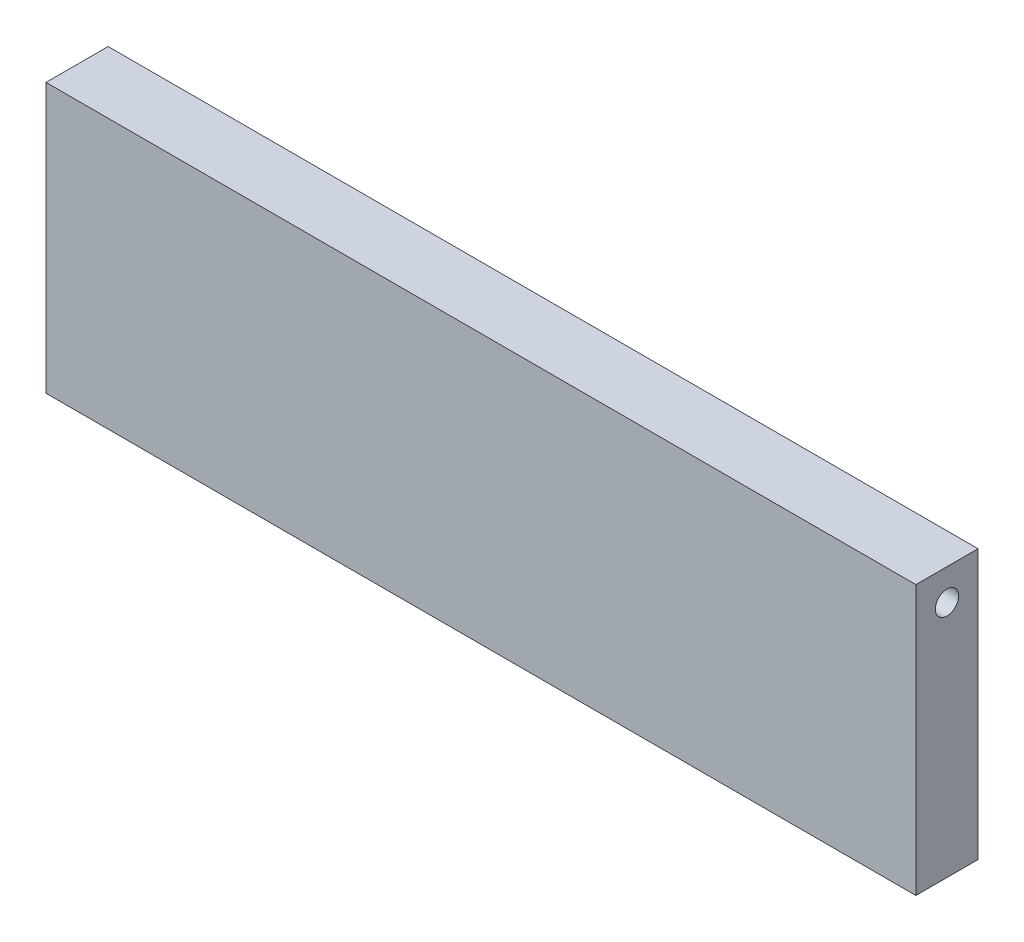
ISO-10303-21;
HEADER;
FILE_DESCRIPTION(('STEP AP214'),'2;1');
FILE_NAME('part.step','',(''),(''),'','','');
FILE_SCHEMA(('AUTOMOTIVE_DESIGN { 1 0 10303 214 1 1 1 1 }'));
ENDSEC;
DATA;
#1=APPLICATION_CONTEXT('core data for automotive mechanical design processes');
#2=APPLICATION_PROTOCOL_DEFINITION('international standard','automotive_design',2000,#1);
#3=PRODUCT_CONTEXT('',#1,'mechanical');
#4=PRODUCT('Part','Part','',(#3));
#5=PRODUCT_RELATED_PRODUCT_CATEGORY('part','',(#4));
#6=PRODUCT_DEFINITION_FORMATION('','',#4);
#7=PRODUCT_DEFINITION_CONTEXT('part definition',#1,'design');
#8=PRODUCT_DEFINITION('design','',#6,#7);
#9=PRODUCT_DEFINITION_SHAPE('','',#8);
#10=(LENGTH_UNIT() NAMED_UNIT(*) SI_UNIT(.MILLI.,.METRE.));
#11=(NAMED_UNIT(*) PLANE_ANGLE_UNIT() SI_UNIT($,.RADIAN.));
#12=(NAMED_UNIT(*) SI_UNIT($,.STERADIAN.) SOLID_ANGLE_UNIT());
#13=UNCERTAINTY_MEASURE_WITH_UNIT(LENGTH_MEASURE(1.E-05),#10,'distance_accuracy_value','');
#14=(GEOMETRIC_REPRESENTATION_CONTEXT(3) GLOBAL_UNCERTAINTY_ASSIGNED_CONTEXT((#13)) GLOBAL_UNIT_ASSIGNED_CONTEXT((#10,
#11,#12)) REPRESENTATION_CONTEXT('',''));
#15=CARTESIAN_POINT('',(0.,0.,0.));
#16=DIRECTION('',(0.,0.,1.));
#17=DIRECTION('',(1.,0.,0.));
#18=AXIS2_PLACEMENT_3D('',#15,#16,#17);
#19=CARTESIAN_POINT('',(228.,210.,-87.));
#20=DIRECTION('',(-1.,0.,0.));
#21=DIRECTION('',(0.,0.,1.));
#22=AXIS2_PLACEMENT_3D('',#19,#20,#21);
#23=PLANE('',#22);
#24=CARTESIAN_POINT('',(228.,256.,-81.));
#25=DIRECTION('',(-1.,0.,0.));
#26=DIRECTION('',(0.,0.,1.));
#27=AXIS2_PLACEMENT_3D('',#24,#25,#26);
#28=CIRCLE('',#27,2.24999999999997);
#29=CARTESIAN_POINT('',(228.,256.,-78.7500000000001));
#30=VERTEX_POINT('',#29);
#31=EDGE_CURVE('E38',#30,#30,#28,.T.);
#32=ORIENTED_EDGE('',*,*,#31,.T.);
#33=EDGE_LOOP('',(#32));
#34=FACE_BOUND('',#33,.T.);
#35=DIRECTION('',(0.,-1.,0.));
#36=VECTOR('',#35,1.);
#37=CARTESIAN_POINT('',(228.,210.,-75.));
#38=LINE('',#37,#36);
#39=CARTESIAN_POINT('',(228.,262.,-75.));
#40=VERTEX_POINT('',#39);
#41=CARTESIAN_POINT('',(228.,210.,-75.));
#42=VERTEX_POINT('',#41);
#43=EDGE_CURVE('E110',#40,#42,#38,.T.);
#44=ORIENTED_EDGE('',*,*,#43,.T.);
#45=DIRECTION('',(0.,0.,1.));
#46=VECTOR('',#45,1.);
#47=CARTESIAN_POINT('',(228.,210.,-87.));
#48=LINE('',#47,#46);
#49=CARTESIAN_POINT('',(228.,210.,-87.));
#50=VERTEX_POINT('',#49);
#51=EDGE_CURVE('E11',#50,#42,#48,.T.);
#52=ORIENTED_EDGE('',*,*,#51,.F.);
#53=DIRECTION('',(0.,-1.,0.));
#54=VECTOR('',#53,1.);
#55=CARTESIAN_POINT('',(228.,210.,-87.));
#56=LINE('',#55,#54);
#57=CARTESIAN_POINT('',(228.,262.,-87.));
#58=VERTEX_POINT('',#57);
#59=EDGE_CURVE('E120',#58,#50,#56,.T.);
#60=ORIENTED_EDGE('',*,*,#59,.F.);
#61=DIRECTION('',(0.,0.,1.));
#62=VECTOR('',#61,1.);
#63=CARTESIAN_POINT('',(228.,262.,-87.));
#64=LINE('',#63,#62);
#65=EDGE_CURVE('E126',#58,#40,#64,.T.);
#66=ORIENTED_EDGE('',*,*,#65,.T.);
#67=EDGE_LOOP('',(#44,#52,#60,#66));
#68=FACE_BOUND('',#67,.T.);
#69=ADVANCED_FACE('F35',(#34,#68),#23,.F.);
#70=CARTESIAN_POINT('',(228.,210.,-87.));
#71=DIRECTION('',(0.,1.,0.));
#72=DIRECTION('',(0.,0.,1.));
#73=AXIS2_PLACEMENT_3D('',#70,#71,#72);
#74=PLANE('',#73);
#75=DIRECTION('',(-1.,0.,0.));
#76=VECTOR('',#75,1.);
#77=CARTESIAN_POINT('',(228.,210.,-75.));
#78=LINE('',#77,#76);
#79=CARTESIAN_POINT('',(60.,210.,-75.));
#80=VERTEX_POINT('',#79);
#81=EDGE_CURVE('E129',#42,#80,#78,.T.);
#82=ORIENTED_EDGE('',*,*,#81,.T.);
#83=DIRECTION('',(0.,0.,1.));
#84=VECTOR('',#83,1.);
#85=CARTESIAN_POINT('',(60.,210.,-87.));
#86=LINE('',#85,#84);
#87=CARTESIAN_POINT('',(60.,210.,-87.));
#88=VERTEX_POINT('',#87);
#89=EDGE_CURVE('E44',#88,#80,#86,.T.);
#90=ORIENTED_EDGE('',*,*,#89,.F.);
#91=DIRECTION('',(-1.,0.,0.));
#92=VECTOR('',#91,1.);
#93=CARTESIAN_POINT('',(228.,210.,-87.));
#94=LINE('',#93,#92);
#95=EDGE_CURVE('E84',#50,#88,#94,.T.);
#96=ORIENTED_EDGE('',*,*,#95,.F.);
#97=ORIENTED_EDGE('',*,*,#51,.T.);
#98=EDGE_LOOP('',(#82,#90,#96,#97));
#99=FACE_BOUND('',#98,.T.);
#100=ADVANCED_FACE('F158',(#99),#74,.F.);
#101=CARTESIAN_POINT('',(60.,210.,-87.));
#102=DIRECTION('',(1.,0.,0.));
#103=DIRECTION('',(0.,0.,-1.));
#104=AXIS2_PLACEMENT_3D('',#101,#102,#103);
#105=PLANE('',#104);
#106=CARTESIAN_POINT('',(60.,256.,-81.));
#107=DIRECTION('',(1.,0.,0.));
#108=DIRECTION('',(0.,0.,-1.));
#109=AXIS2_PLACEMENT_3D('',#106,#107,#108);
#110=CIRCLE('',#109,2.24999999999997);
#111=CARTESIAN_POINT('',(60.,256.,-83.25));
#112=VERTEX_POINT('',#111);
#113=EDGE_CURVE('E106',#112,#112,#110,.T.);
#114=ORIENTED_EDGE('',*,*,#113,.T.);
#115=EDGE_LOOP('',(#114));
#116=FACE_BOUND('',#115,.T.);
#117=DIRECTION('',(0.,1.,0.));
#118=VECTOR('',#117,1.);
#119=CARTESIAN_POINT('',(60.,210.,-75.));
#120=LINE('',#119,#118);
#121=CARTESIAN_POINT('',(60.,262.,-75.));
#122=VERTEX_POINT('',#121);
#123=EDGE_CURVE('E71',#80,#122,#120,.T.);
#124=ORIENTED_EDGE('',*,*,#123,.T.);
#125=DIRECTION('',(0.,0.,1.));
#126=VECTOR('',#125,1.);
#127=CARTESIAN_POINT('',(60.,262.,-87.));
#128=LINE('',#127,#126);
#129=CARTESIAN_POINT('',(60.,262.,-87.));
#130=VERTEX_POINT('',#129);
#131=EDGE_CURVE('E134',#130,#122,#128,.T.);
#132=ORIENTED_EDGE('',*,*,#131,.F.);
#133=DIRECTION('',(0.,1.,0.));
#134=VECTOR('',#133,1.);
#135=CARTESIAN_POINT('',(60.,210.,-87.));
#136=LINE('',#135,#134);
#137=EDGE_CURVE('E123',#88,#130,#136,.T.);
#138=ORIENTED_EDGE('',*,*,#137,.F.);
#139=ORIENTED_EDGE('',*,*,#89,.T.);
#140=EDGE_LOOP('',(#124,#132,#138,#139));
#141=FACE_BOUND('',#140,.T.);
#142=ADVANCED_FACE('F139',(#116,#141),#105,.F.);
#143=CARTESIAN_POINT('',(228.,262.,-87.));
#144=DIRECTION('',(0.,-1.,0.));
#145=DIRECTION('',(0.,0.,-1.));
#146=AXIS2_PLACEMENT_3D('',#143,#144,#145);
#147=PLANE('',#146);
#148=DIRECTION('',(1.,0.,0.));
#149=VECTOR('',#148,1.);
#150=CARTESIAN_POINT('',(228.,262.,-75.));
#151=LINE('',#150,#149);
#152=EDGE_CURVE('E77',#122,#40,#151,.T.);
#153=ORIENTED_EDGE('',*,*,#152,.T.);
#154=ORIENTED_EDGE('',*,*,#65,.F.);
#155=DIRECTION('',(1.,0.,0.));
#156=VECTOR('',#155,1.);
#157=CARTESIAN_POINT('',(228.,262.,-87.));
#158=LINE('',#157,#156);
#159=EDGE_CURVE('E53',#130,#58,#158,.T.);
#160=ORIENTED_EDGE('',*,*,#159,.F.);
#161=ORIENTED_EDGE('',*,*,#131,.T.);
#162=EDGE_LOOP('',(#153,#154,#160,#161));
#163=FACE_BOUND('',#162,.T.);
#164=ADVANCED_FACE('F173',(#163),#147,.F.);
#165=CARTESIAN_POINT('',(0.,0.,-87.));
#166=DIRECTION('',(0.,0.,1.));
#167=DIRECTION('',(1.,0.,0.));
#168=AXIS2_PLACEMENT_3D('',#165,#166,#167);
#169=PLANE('',#168);
#170=CARTESIAN_POINT('',(186.,240.,-87.));
#171=DIRECTION('',(0.,0.,-1.));
#172=DIRECTION('',(-1.,0.,0.));
#173=AXIS2_PLACEMENT_3D('',#170,#171,#172);
#174=CIRCLE('',#173,2.5);
#175=CARTESIAN_POINT('',(183.5,240.,-87.));
#176=VERTEX_POINT('',#175);
#177=EDGE_CURVE('E111',#176,#176,#174,.T.);
#178=ORIENTED_EDGE('',*,*,#177,.F.);
#179=EDGE_LOOP('',(#178));
#180=FACE_BOUND('',#179,.T.);
#181=CARTESIAN_POINT('',(102.,240.,-87.));
#182=DIRECTION('',(0.,0.,-1.));
#183=DIRECTION('',(-1.,0.,0.));
#184=AXIS2_PLACEMENT_3D('',#181,#182,#183);
#185=CIRCLE('',#184,2.5);
#186=CARTESIAN_POINT('',(99.5,240.,-87.));
#187=VERTEX_POINT('',#186);
#188=EDGE_CURVE('E117',#187,#187,#185,.T.);
#189=ORIENTED_EDGE('',*,*,#188,.F.);
#190=EDGE_LOOP('',(#189));
#191=FACE_BOUND('',#190,.T.);
#192=ORIENTED_EDGE('',*,*,#59,.T.);
#193=ORIENTED_EDGE('',*,*,#95,.T.);
#194=ORIENTED_EDGE('',*,*,#137,.T.);
#195=ORIENTED_EDGE('',*,*,#159,.T.);
#196=EDGE_LOOP('',(#192,#193,#194,#195));
#197=FACE_BOUND('',#196,.T.);
#198=ADVANCED_FACE('F171',(#180,#191,#197),#169,.F.);
#199=CARTESIAN_POINT('',(0.,0.,-75.));
#200=DIRECTION('',(0.,0.,1.));
#201=DIRECTION('',(1.,0.,0.));
#202=AXIS2_PLACEMENT_3D('',#199,#200,#201);
#203=PLANE('',#202);
#204=ORIENTED_EDGE('',*,*,#43,.F.);
#205=ORIENTED_EDGE('',*,*,#152,.F.);
#206=ORIENTED_EDGE('',*,*,#123,.F.);
#207=ORIENTED_EDGE('',*,*,#81,.F.);
#208=EDGE_LOOP('',(#204,#205,#206,#207));
#209=FACE_BOUND('',#208,.T.);
#210=ADVANCED_FACE('F169',(#209),#203,.T.);
#211=CARTESIAN_POINT('',(102.,240.,-81.));
#212=DIRECTION('',(0.,0.,-1.));
#213=DIRECTION('',(-1.,0.,0.));
#214=AXIS2_PLACEMENT_3D('',#211,#212,#213);
#215=CYLINDRICAL_SURFACE('',#214,2.5);
#216=CARTESIAN_POINT('',(102.,240.,-81.));
#217=DIRECTION('',(0.,0.,-1.));
#218=DIRECTION('',(-1.,0.,0.));
#219=AXIS2_PLACEMENT_3D('',#216,#217,#218);
#220=CIRCLE('',#219,2.5);
#221=CARTESIAN_POINT('',(99.5,240.,-81.));
#222=VERTEX_POINT('',#221);
#223=EDGE_CURVE('E114',#222,#222,#220,.T.);
#224=ORIENTED_EDGE('',*,*,#223,.F.);
#225=EDGE_LOOP('',(#224));
#226=FACE_BOUND('',#225,.T.);
#227=ORIENTED_EDGE('',*,*,#188,.T.);
#228=EDGE_LOOP('',(#227));
#229=FACE_BOUND('',#228,.T.);
#230=ADVANCED_FACE('F180',(#226,#229),#215,.F.);
#231=CARTESIAN_POINT('',(102.,240.,-81.));
#232=DIRECTION('',(0.,0.,-1.));
#233=DIRECTION('',(-1.,0.,0.));
#234=AXIS2_PLACEMENT_3D('',#231,#232,#233);
#235=PLANE('',#234);
#236=ORIENTED_EDGE('',*,*,#223,.T.);
#237=EDGE_LOOP('',(#236));
#238=FACE_BOUND('',#237,.T.);
#239=ADVANCED_FACE('F223',(#238),#235,.T.);
#240=CARTESIAN_POINT('',(186.,240.,-81.));
#241=DIRECTION('',(0.,0.,-1.));
#242=DIRECTION('',(-1.,0.,0.));
#243=AXIS2_PLACEMENT_3D('',#240,#241,#242);
#244=CYLINDRICAL_SURFACE('',#243,2.5);
#245=CARTESIAN_POINT('',(186.,240.,-81.));
#246=DIRECTION('',(0.,0.,-1.));
#247=DIRECTION('',(-1.,0.,0.));
#248=AXIS2_PLACEMENT_3D('',#245,#246,#247);
#249=CIRCLE('',#248,2.5);
#250=CARTESIAN_POINT('',(183.5,240.,-81.));
#251=VERTEX_POINT('',#250);
#252=EDGE_CURVE('E107',#251,#251,#249,.T.);
#253=ORIENTED_EDGE('',*,*,#252,.F.);
#254=EDGE_LOOP('',(#253));
#255=FACE_BOUND('',#254,.T.);
#256=ORIENTED_EDGE('',*,*,#177,.T.);
#257=EDGE_LOOP('',(#256));
#258=FACE_BOUND('',#257,.T.);
#259=ADVANCED_FACE('F153',(#255,#258),#244,.F.);
#260=CARTESIAN_POINT('',(186.,240.,-81.));
#261=DIRECTION('',(0.,0.,-1.));
#262=DIRECTION('',(-1.,0.,0.));
#263=AXIS2_PLACEMENT_3D('',#260,#261,#262);
#264=PLANE('',#263);
#265=ORIENTED_EDGE('',*,*,#252,.T.);
#266=EDGE_LOOP('',(#265));
#267=FACE_BOUND('',#266,.T.);
#268=ADVANCED_FACE('F144',(#267),#264,.T.);
#269=CARTESIAN_POINT('',(48.,256.,-81.));
#270=DIRECTION('',(-1.,0.,0.));
#271=DIRECTION('',(0.,0.,1.));
#272=AXIS2_PLACEMENT_3D('',#269,#270,#271);
#273=CYLINDRICAL_SURFACE('',#272,2.24999999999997);
#274=CARTESIAN_POINT('',(76.648063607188,256.,-81.));
#275=DIRECTION('',(-1.,0.,0.));
#276=DIRECTION('',(0.,0.,1.));
#277=AXIS2_PLACEMENT_3D('',#274,#275,#276);
#278=CIRCLE('',#277,2.24999999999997);
#279=CARTESIAN_POINT('',(76.648063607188,256.,-78.7500000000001));
#280=VERTEX_POINT('',#279);
#281=EDGE_CURVE('E102',#280,#280,#278,.T.);
#282=ORIENTED_EDGE('',*,*,#281,.F.);
#283=EDGE_LOOP('',(#282));
#284=FACE_BOUND('',#283,.T.);
#285=ORIENTED_EDGE('',*,*,#113,.F.);
#286=EDGE_LOOP('',(#285));
#287=FACE_BOUND('',#286,.T.);
#288=ADVANCED_FACE('F141',(#284,#287),#273,.F.);
#289=CARTESIAN_POINT('',(76.648063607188,256.,-81.));
#290=DIRECTION('',(-1.,0.,0.));
#291=DIRECTION('',(0.,0.,1.));
#292=AXIS2_PLACEMENT_3D('',#289,#290,#291);
#293=CONICAL_SURFACE('',#292,2.24999999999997,1.02974425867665);
#294=CARTESIAN_POINT('',(78.,256.,-81.));
#295=VERTEX_POINT('',#294);
#296=VERTEX_LOOP('',#295);
#297=FACE_BOUND('',#296,.T.);
#298=ORIENTED_EDGE('',*,*,#281,.T.);
#299=EDGE_LOOP('',(#298));
#300=FACE_BOUND('',#299,.T.);
#301=ADVANCED_FACE('F143',(#297,#300),#293,.F.);
#302=CARTESIAN_POINT('',(240.,256.,-81.));
#303=DIRECTION('',(1.,0.,0.));
#304=DIRECTION('',(0.,0.,-1.));
#305=AXIS2_PLACEMENT_3D('',#302,#303,#304);
#306=CYLINDRICAL_SURFACE('',#305,2.24999999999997);
#307=CARTESIAN_POINT('',(211.351936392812,256.,-81.));
#308=DIRECTION('',(1.,0.,0.));
#309=DIRECTION('',(0.,0.,-1.));
#310=AXIS2_PLACEMENT_3D('',#307,#308,#309);
#311=CIRCLE('',#310,2.24999999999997);
#312=CARTESIAN_POINT('',(211.351936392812,256.,-83.25));
#313=VERTEX_POINT('',#312);
#314=EDGE_CURVE('E98',#313,#313,#311,.T.);
#315=ORIENTED_EDGE('',*,*,#314,.F.);
#316=EDGE_LOOP('',(#315));
#317=FACE_BOUND('',#316,.T.);
#318=ORIENTED_EDGE('',*,*,#31,.F.);
#319=EDGE_LOOP('',(#318));
#320=FACE_BOUND('',#319,.T.);
#321=ADVANCED_FACE('F94',(#317,#320),#306,.F.);
#322=CARTESIAN_POINT('',(211.351936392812,256.,-81.));
#323=DIRECTION('',(1.,0.,0.));
#324=DIRECTION('',(0.,0.,-1.));
#325=AXIS2_PLACEMENT_3D('',#322,#323,#324);
#326=CONICAL_SURFACE('',#325,2.24999999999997,1.02974425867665);
#327=CARTESIAN_POINT('',(210.,256.,-81.));
#328=VERTEX_POINT('',#327);
#329=VERTEX_LOOP('',#328);
#330=FACE_BOUND('',#329,.T.);
#331=ORIENTED_EDGE('',*,*,#314,.T.);
#332=EDGE_LOOP('',(#331));
#333=FACE_BOUND('',#332,.T.);
#334=ADVANCED_FACE('F91',(#330,#333),#326,.F.);
#335=CLOSED_SHELL('',(#69,#100,#142,#164,#198,#210,#230,#239,#259,#268,#288,#301,#321,#334));
#336=MANIFOLD_SOLID_BREP('B2',#335);
#337=ADVANCED_BREP_SHAPE_REPRESENTATION('',(#18,#336),#14);
#338=SHAPE_DEFINITION_REPRESENTATION(#9,#337);
ENDSEC;
END-ISO-10303-21;
